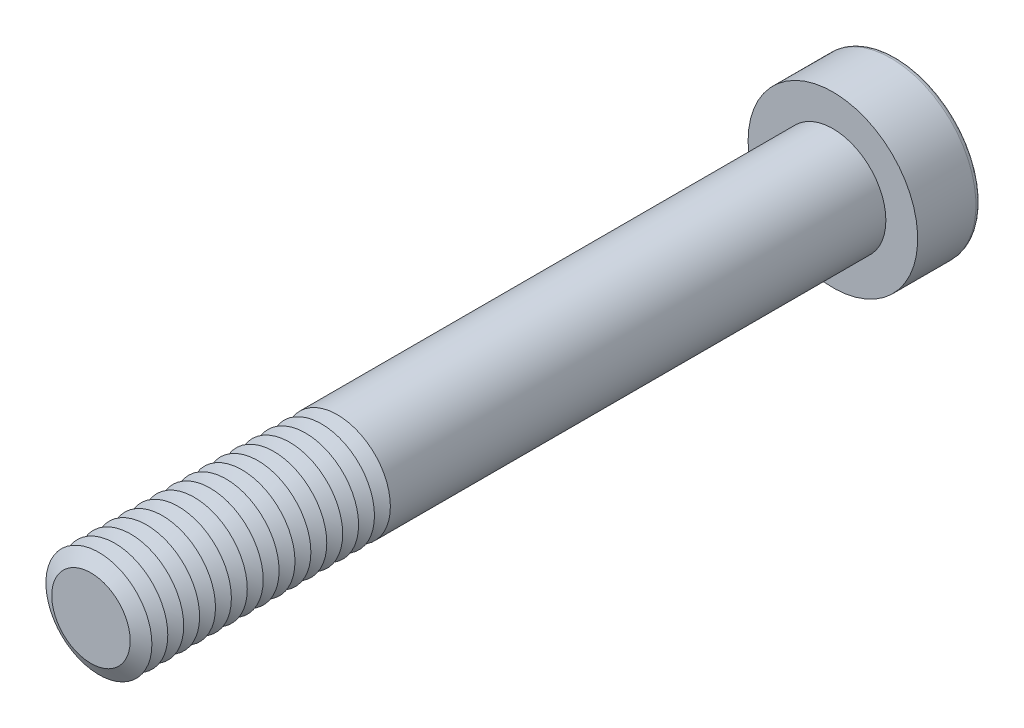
from build123d import *

# Parameters (mm, degrees)
SKETCH1_R           = 5
BOSS_EXTRUDE1_DEPTH = 70
SKETCH2_R           = 8
BOSS_EXTRUDE2_DEPTH = 6
CUT_EXTRUDE1_DEPTH  = 5.25
FILLET1_R           = 0.5
LPATTERN1_COUNT     = 16
LPATTERN1_PITCH     = 1.5


with BuildPart() as part:
    # Sketch1 → Boss-Extrude1 (new body)
    with BuildSketch(Plane.XY):
        Circle(SKETCH1_R)
    extrude(amount=BOSS_EXTRUDE1_DEPTH)

    # Sketch2 → Boss-Extrude2 (add)
    with BuildSketch(Plane(origin=(0, 0, 0), x_dir=(-1, 0, 0), z_dir=(0, 0, -1))):
        Circle(SKETCH2_R)
    extrude(amount=BOSS_EXTRUDE2_DEPTH)

    # Sketch3 → Cut-Extrude1 (cut)
    with BuildSketch(Plane(origin=(0, 0, -6), x_dir=(-1, 0, 0), z_dir=(0, 0, -1))):
        Polygon((-2.020725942, 3.5), (-4.041451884, 0), (-2.020725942, -3.5), (2.020725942, -3.5), (4.041451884, 0), (2.020725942, 3.5), align=None)
    extrude(amount=-CUT_EXTRUDE1_DEPTH, mode=Mode.SUBTRACT)

    # Fillet1
    fillet1_edges = [part.edges().sort_by_distance(p)[0] for p in [
        (8, 0, -6),
    ]]
    fillet(fillet1_edges, radius=FILLET1_R)

    # Cut-Extrude2 cone 1 section (on through the dimple's axis) → Cut-Extrude2 (revolve, cut)
    with BuildSketch(Plane(origin=(0, 0, -0.75), x_dir=(0, 1, 0), z_dir=(1, 0, 0))):
        Polygon((0, 0), (3.5, 0), (0, 2.020725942), align=None)
    revolve(axis=Axis((0, 0, -0.75), (0, 0, 1)), mode=Mode.SUBTRACT)

    # Cut-Extrude3 cone 1 section (on through the dimple's axis) → Cut-Extrude3 (revolve, cut)
    with BuildSketch(Plane(origin=(0, 0, -6), x_dir=(0, 1, 0), z_dir=(1, 0, 0))):
        Polygon((0, 0), (4.041451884, 0), (0, 1.082903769), align=None)
    revolve(axis=Axis((0, 0, -6), (0, 0, 1)), mode=Mode.SUBTRACT)

    # Sketch7 → Cut-Revolve1 (revolve, cut)
    with BuildSketch(Plane(origin=(0, 0, 0), x_dir=(0, 0, -1), z_dir=(1, 0, 0)), mode=Mode.PRIVATE) as cut_revolve1_sk:
        Polygon((-70, 3.700961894), (-69.25, 5), (-70.75, 5), align=None)
    cut_revolve1 = revolve(cut_revolve1_sk.sketch.rotate(Axis((0, 0, 70), (0, 0, -1)), 90), axis=Axis((0, 0, 70), (0, 0, -1)), mode=Mode.SUBTRACT)

    # LPattern1: Cut-Revolve1 ×16
    with Locations(*[(0, 0, -i * LPATTERN1_PITCH) for i in range(1, LPATTERN1_COUNT)]):
        add(cut_revolve1, mode=Mode.SUBTRACT)


solid = part.part
